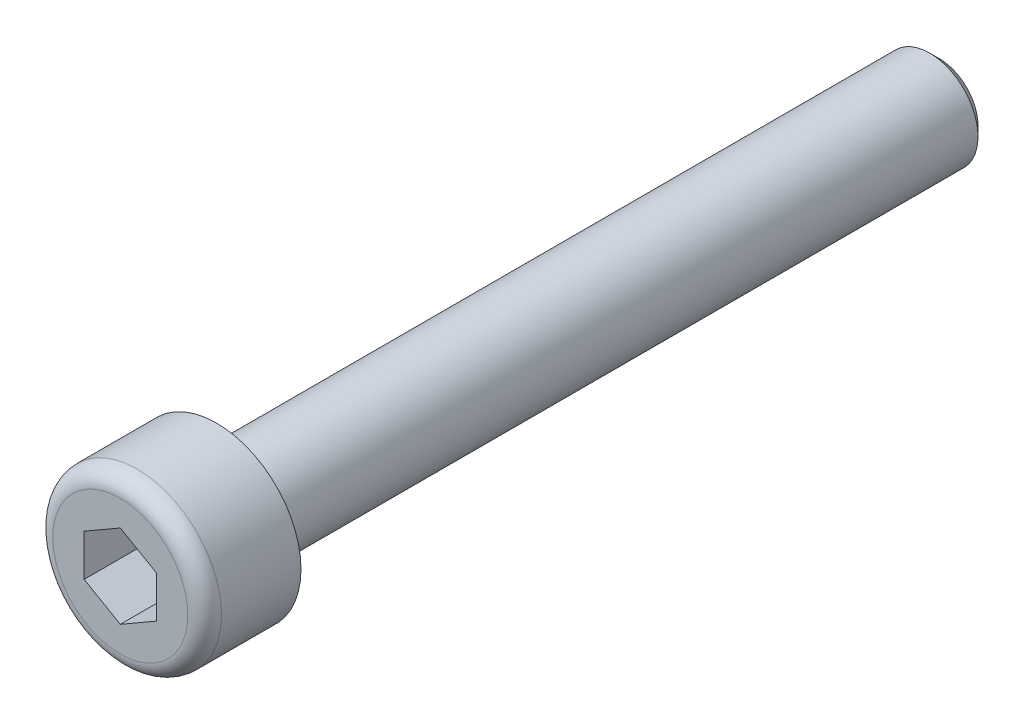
from build123d import *

# Parameters (mm, degrees)
ESQUISSE1_R             = 2
BASE_EXTRUSION_DEPTH    = 30
ESQUISSE2_R             = 3.5
BOSS_EXTRU_1_DEPTH      = 4
CHANFREIN1_SIZE         = 0.4
CONG_1_R                = 0.7
ENL_V_MAT_EXTRU_1_DEPTH = 2.5


with BuildPart() as part:
    # Esquisse1 → Base-Extrusion (new body)
    with BuildSketch(Plane.XY):
        Circle(ESQUISSE1_R)
    extrude(amount=BASE_EXTRUSION_DEPTH)

    # Esquisse2 → Boss.-Extru.1 (add)
    with BuildSketch(Plane.XY.offset(30)):
        Circle(ESQUISSE2_R)
    extrude(amount=BOSS_EXTRU_1_DEPTH)

    # Chanfrein1
    chanfrein1_edges = [part.edges().sort_by_distance(p)[0] for p in [
        (-2, 0, 0),
    ]]
    chamfer(chanfrein1_edges, length=CHANFREIN1_SIZE)

    # Cong_1
    cong_1_edges = [part.edges().sort_by_distance(p)[0] for p in [
        (-3.5, 0, 34),
    ]]
    fillet(cong_1_edges, radius=CONG_1_R)

    # Esquisse3 → Enl_v. mat.-Extru.1 (cut)
    with BuildSketch(Plane.XY.offset(34)):
        Polygon((0, 1.732050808), (-1.5, 0.866025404), (-1.5, -0.866025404), (0, -1.732050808), (1.5, -0.866025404), (1.5, 0.866025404), align=None)
    extrude(amount=-ENL_V_MAT_EXTRU_1_DEPTH, mode=Mode.SUBTRACT)


solid = part.part
